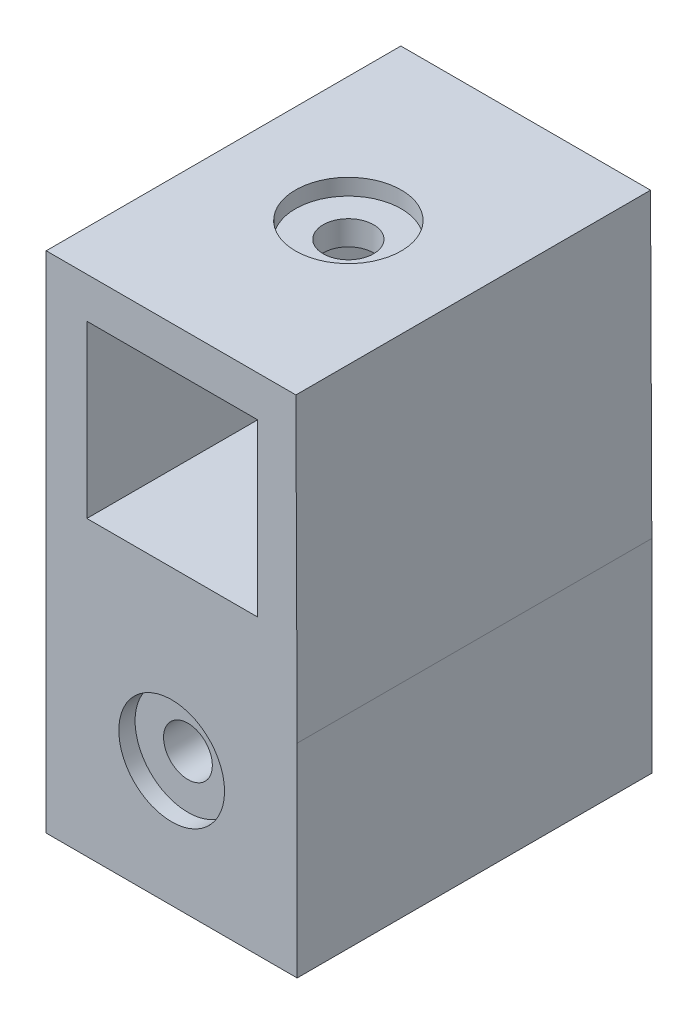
ISO-10303-21;
HEADER;
FILE_DESCRIPTION(('STEP AP214'),'2;1');
FILE_NAME('part.step','',(''),(''),'','','');
FILE_SCHEMA(('AUTOMOTIVE_DESIGN { 1 0 10303 214 1 1 1 1 }'));
ENDSEC;
DATA;
#1=APPLICATION_CONTEXT('core data for automotive mechanical design processes');
#2=APPLICATION_PROTOCOL_DEFINITION('international standard','automotive_design',2000,#1);
#3=PRODUCT_CONTEXT('',#1,'mechanical');
#4=PRODUCT('Part','Part','',(#3));
#5=PRODUCT_RELATED_PRODUCT_CATEGORY('part','',(#4));
#6=PRODUCT_DEFINITION_FORMATION('','',#4);
#7=PRODUCT_DEFINITION_CONTEXT('part definition',#1,'design');
#8=PRODUCT_DEFINITION('design','',#6,#7);
#9=PRODUCT_DEFINITION_SHAPE('','',#8);
#10=(LENGTH_UNIT() NAMED_UNIT(*) SI_UNIT(.MILLI.,.METRE.));
#11=(NAMED_UNIT(*) PLANE_ANGLE_UNIT() SI_UNIT($,.RADIAN.));
#12=(NAMED_UNIT(*) SI_UNIT($,.STERADIAN.) SOLID_ANGLE_UNIT());
#13=UNCERTAINTY_MEASURE_WITH_UNIT(LENGTH_MEASURE(1.E-05),#10,'distance_accuracy_value','');
#14=(GEOMETRIC_REPRESENTATION_CONTEXT(3) GLOBAL_UNCERTAINTY_ASSIGNED_CONTEXT((#13)) GLOBAL_UNIT_ASSIGNED_CONTEXT((#10,
#11,#12)) REPRESENTATION_CONTEXT('',''));
#15=CARTESIAN_POINT('',(0.,0.,0.));
#16=DIRECTION('',(0.,0.,1.));
#17=DIRECTION('',(1.,0.,0.));
#18=AXIS2_PLACEMENT_3D('',#15,#16,#17);
#19=CARTESIAN_POINT('',(-15.5623827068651,-26.3441946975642,-5.2));
#20=DIRECTION('',(0.,0.,1.));
#21=DIRECTION('',(1.,0.,0.));
#22=AXIS2_PLACEMENT_3D('',#19,#20,#21);
#23=CYLINDRICAL_SURFACE('',#22,3.);
#24=CARTESIAN_POINT('',(-15.5623827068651,-26.3441946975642,10.5));
#25=DIRECTION('',(0.,0.,1.));
#26=DIRECTION('',(1.,0.,0.));
#27=AXIS2_PLACEMENT_3D('',#24,#25,#26);
#28=CIRCLE('',#27,3.);
#29=CARTESIAN_POINT('',(-12.5623827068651,-26.3441946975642,10.5));
#30=VERTEX_POINT('',#29);
#31=EDGE_CURVE('E184',#30,#30,#28,.T.);
#32=ORIENTED_EDGE('',*,*,#31,.F.);
#33=EDGE_LOOP('',(#32));
#34=FACE_BOUND('',#33,.T.);
#35=CARTESIAN_POINT('',(-15.5623827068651,-26.3441946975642,19.8));
#36=DIRECTION('',(0.,0.,1.));
#37=DIRECTION('',(1.,0.,0.));
#38=AXIS2_PLACEMENT_3D('',#35,#36,#37);
#39=CIRCLE('',#38,3.);
#40=CARTESIAN_POINT('',(-12.5623827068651,-26.3441946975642,19.8));
#41=VERTEX_POINT('',#40);
#42=EDGE_CURVE('E51',#41,#41,#39,.F.);
#43=ORIENTED_EDGE('',*,*,#42,.F.);
#44=EDGE_LOOP('',(#43));
#45=FACE_BOUND('',#44,.T.);
#46=ADVANCED_FACE('F47',(#34,#45),#23,.F.);
#47=CARTESIAN_POINT('',(-30.989332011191,0.,-21.8));
#48=DIRECTION('',(-1.,0.,0.));
#49=DIRECTION('',(0.,0.,1.));
#50=AXIS2_PLACEMENT_3D('',#47,#48,#49);
#51=PLANE('',#50);
#52=DIRECTION('',(0.,-1.,0.));
#53=VECTOR('',#52,1.);
#54=CARTESIAN_POINT('',(-30.989332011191,0.,-21.8));
#55=LINE('',#54,#53);
#56=CARTESIAN_POINT('',(-30.989332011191,20.241694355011,-21.8));
#57=VERTEX_POINT('',#56);
#58=CARTESIAN_POINT('',(-30.9893320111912,-41.7583056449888,-21.8));
#59=VERTEX_POINT('',#58);
#60=EDGE_CURVE('E290',#57,#59,#55,.T.);
#61=ORIENTED_EDGE('',*,*,#60,.T.);
#62=DIRECTION('',(0.,0.,-1.));
#63=VECTOR('',#62,1.);
#64=CARTESIAN_POINT('',(-30.9893320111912,-41.7583056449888,21.8));
#65=LINE('',#64,#63);
#66=CARTESIAN_POINT('',(-30.9893320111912,-41.7583056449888,21.8));
#67=VERTEX_POINT('',#66);
#68=EDGE_CURVE('E193',#67,#59,#65,.T.);
#69=ORIENTED_EDGE('',*,*,#68,.F.);
#70=DIRECTION('',(0.,-1.,0.));
#71=VECTOR('',#70,1.);
#72=CARTESIAN_POINT('',(-30.989332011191,0.,21.8));
#73=LINE('',#72,#71);
#74=CARTESIAN_POINT('',(-30.989332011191,20.241694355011,21.8));
#75=VERTEX_POINT('',#74);
#76=EDGE_CURVE('E279',#75,#67,#73,.T.);
#77=ORIENTED_EDGE('',*,*,#76,.F.);
#78=DIRECTION('',(0.,0.,1.));
#79=VECTOR('',#78,1.);
#80=CARTESIAN_POINT('',(-30.989332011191,20.241694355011,-21.8));
#81=LINE('',#80,#79);
#82=EDGE_CURVE('E11',#57,#75,#81,.T.);
#83=ORIENTED_EDGE('',*,*,#82,.F.);
#84=EDGE_LOOP('',(#61,#69,#77,#83));
#85=FACE_BOUND('',#84,.T.);
#86=ADVANCED_FACE('F341',(#85),#51,.T.);
#87=CARTESIAN_POINT('',(0.,20.241694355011,-21.8));
#88=DIRECTION('',(0.,1.,0.));
#89=DIRECTION('',(0.,0.,1.));
#90=AXIS2_PLACEMENT_3D('',#87,#88,#89);
#91=PLANE('',#90);
#92=CARTESIAN_POINT('',(-15.6401057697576,20.241694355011,0.));
#93=DIRECTION('',(0.,1.,0.));
#94=DIRECTION('',(0.,0.,1.));
#95=AXIS2_PLACEMENT_3D('',#92,#93,#94);
#96=CIRCLE('',#95,6.5);
#97=CARTESIAN_POINT('',(-15.6401057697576,20.241694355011,6.5));
#98=VERTEX_POINT('',#97);
#99=EDGE_CURVE('E262',#98,#98,#96,.T.);
#100=ORIENTED_EDGE('',*,*,#99,.F.);
#101=EDGE_LOOP('',(#100));
#102=FACE_BOUND('',#101,.T.);
#103=ORIENTED_EDGE('',*,*,#82,.T.);
#104=DIRECTION('',(-1.,0.,0.));
#105=VECTOR('',#104,1.);
#106=CARTESIAN_POINT('',(0.,20.241694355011,21.8));
#107=LINE('',#106,#105);
#108=CARTESIAN_POINT('',(-0.290879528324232,20.241694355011,21.8));
#109=VERTEX_POINT('',#108);
#110=EDGE_CURVE('E275',#109,#75,#107,.T.);
#111=ORIENTED_EDGE('',*,*,#110,.F.);
#112=DIRECTION('',(0.,0.,1.));
#113=VECTOR('',#112,1.);
#114=CARTESIAN_POINT('',(-0.290879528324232,20.241694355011,-21.8));
#115=LINE('',#114,#113);
#116=CARTESIAN_POINT('',(-0.290879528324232,20.241694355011,-21.8));
#117=VERTEX_POINT('',#116);
#118=EDGE_CURVE('E57',#117,#109,#115,.T.);
#119=ORIENTED_EDGE('',*,*,#118,.F.);
#120=DIRECTION('',(-1.,0.,0.));
#121=VECTOR('',#120,1.);
#122=CARTESIAN_POINT('',(0.,20.241694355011,-21.8));
#123=LINE('',#122,#121);
#124=EDGE_CURVE('E286',#117,#57,#123,.T.);
#125=ORIENTED_EDGE('',*,*,#124,.T.);
#126=EDGE_LOOP('',(#103,#111,#119,#125));
#127=FACE_BOUND('',#126,.T.);
#128=ADVANCED_FACE('F354',(#102,#127),#91,.T.);
#129=CARTESIAN_POINT('',(-0.205835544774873,-0.000864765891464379,-21.8));
#130=DIRECTION('',(0.999991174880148,0.00420120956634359,0.));
#131=DIRECTION('',(-0.00420120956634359,0.999991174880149,0.));
#132=AXIS2_PLACEMENT_3D('',#129,#130,#131);
#133=PLANE('',#132);
#134=ORIENTED_EDGE('',*,*,#118,.T.);
#135=DIRECTION('',(-0.00420120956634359,0.999991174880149,0.));
#136=VECTOR('',#135,1.);
#137=CARTESIAN_POINT('',(-0.205835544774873,-0.000864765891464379,21.8));
#138=LINE('',#137,#136);
#139=CARTESIAN_POINT('',(-0.135433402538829,-16.7583056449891,21.8));
#140=VERTEX_POINT('',#139);
#141=EDGE_CURVE('E271',#140,#109,#138,.T.);
#142=ORIENTED_EDGE('',*,*,#141,.F.);
#143=DIRECTION('',(0.,0.,1.));
#144=VECTOR('',#143,1.);
#145=CARTESIAN_POINT('',(-0.135433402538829,-16.758305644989,-21.8));
#146=LINE('',#145,#144);
#147=CARTESIAN_POINT('',(-0.135433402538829,-16.7583056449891,-21.8));
#148=VERTEX_POINT('',#147);
#149=EDGE_CURVE('E292',#148,#140,#146,.T.);
#150=ORIENTED_EDGE('',*,*,#149,.F.);
#151=DIRECTION('',(-0.00420120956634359,0.999991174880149,0.));
#152=VECTOR('',#151,1.);
#153=CARTESIAN_POINT('',(-0.205835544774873,-0.000864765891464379,-21.8));
#154=LINE('',#153,#152);
#155=EDGE_CURVE('E282',#148,#117,#154,.T.);
#156=ORIENTED_EDGE('',*,*,#155,.T.);
#157=EDGE_LOOP('',(#134,#142,#150,#156));
#158=FACE_BOUND('',#157,.T.);
#159=ADVANCED_FACE('F49',(#158),#133,.T.);
#160=CARTESIAN_POINT('',(0.,0.,-21.8));
#161=DIRECTION('',(0.,0.,1.));
#162=DIRECTION('',(1.,0.,0.));
#163=AXIS2_PLACEMENT_3D('',#160,#161,#162);
#164=PLANE('',#163);
#165=DIRECTION('',(1.,0.,0.));
#166=VECTOR('',#165,1.);
#167=CARTESIAN_POINT('',(0.,-5.75830564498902,-21.8));
#168=LINE('',#167,#166);
#169=CARTESIAN_POINT('',(-25.989332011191,-5.75830564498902,-21.8));
#170=VERTEX_POINT('',#169);
#171=CARTESIAN_POINT('',(-4.98933201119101,-5.75830564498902,-21.8));
#172=VERTEX_POINT('',#171);
#173=EDGE_CURVE('E254',#170,#172,#168,.T.);
#174=ORIENTED_EDGE('',*,*,#173,.T.);
#175=DIRECTION('',(0.,1.,0.));
#176=VECTOR('',#175,1.);
#177=CARTESIAN_POINT('',(-4.98933201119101,0.,-21.8));
#178=LINE('',#177,#176);
#179=CARTESIAN_POINT('',(-4.98933201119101,15.241694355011,-21.8));
#180=VERTEX_POINT('',#179);
#181=EDGE_CURVE('E258',#172,#180,#178,.T.);
#182=ORIENTED_EDGE('',*,*,#181,.T.);
#183=DIRECTION('',(-1.,0.,0.));
#184=VECTOR('',#183,1.);
#185=CARTESIAN_POINT('',(0.,15.241694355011,-21.8));
#186=LINE('',#185,#184);
#187=CARTESIAN_POINT('',(-25.989332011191,15.241694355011,-21.8));
#188=VERTEX_POINT('',#187);
#189=EDGE_CURVE('E246',#180,#188,#186,.T.);
#190=ORIENTED_EDGE('',*,*,#189,.T.);
#191=DIRECTION('',(0.,-1.,0.));
#192=VECTOR('',#191,1.);
#193=CARTESIAN_POINT('',(-25.989332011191,0.,-21.8));
#194=LINE('',#193,#192);
#195=EDGE_CURVE('E250',#188,#170,#194,.T.);
#196=ORIENTED_EDGE('',*,*,#195,.T.);
#197=EDGE_LOOP('',(#174,#182,#190,#196));
#198=FACE_BOUND('',#197,.T.);
#199=ORIENTED_EDGE('',*,*,#155,.F.);
#200=DIRECTION('',(0.,1.,0.));
#201=VECTOR('',#200,1.);
#202=CARTESIAN_POINT('',(-0.135433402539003,-41.7583056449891,-21.8));
#203=LINE('',#202,#201);
#204=CARTESIAN_POINT('',(-0.135433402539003,-41.7583056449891,-21.8));
#205=VERTEX_POINT('',#204);
#206=EDGE_CURVE('E216',#205,#148,#203,.T.);
#207=ORIENTED_EDGE('',*,*,#206,.F.);
#208=DIRECTION('',(1.,0.,0.));
#209=VECTOR('',#208,1.);
#210=CARTESIAN_POINT('',(-30.9893320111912,-41.7583056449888,-21.8));
#211=LINE('',#210,#209);
#212=EDGE_CURVE('E202',#59,#205,#211,.T.);
#213=ORIENTED_EDGE('',*,*,#212,.F.);
#214=ORIENTED_EDGE('',*,*,#60,.F.);
#215=ORIENTED_EDGE('',*,*,#124,.F.);
#216=EDGE_LOOP('',(#199,#207,#213,#214,#215));
#217=FACE_BOUND('',#216,.T.);
#218=ADVANCED_FACE('F326',(#198,#217),#164,.F.);
#219=CARTESIAN_POINT('',(0.,0.,21.8));
#220=DIRECTION('',(0.,0.,1.));
#221=DIRECTION('',(1.,0.,0.));
#222=AXIS2_PLACEMENT_3D('',#219,#220,#221);
#223=PLANE('',#222);
#224=CARTESIAN_POINT('',(-15.5623827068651,-26.3441946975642,21.8));
#225=DIRECTION('',(0.,0.,1.));
#226=DIRECTION('',(1.,0.,0.));
#227=AXIS2_PLACEMENT_3D('',#224,#225,#226);
#228=CIRCLE('',#227,6.5);
#229=CARTESIAN_POINT('',(-9.06238270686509,-26.3441946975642,21.8));
#230=VERTEX_POINT('',#229);
#231=EDGE_CURVE('E174',#230,#230,#228,.T.);
#232=ORIENTED_EDGE('',*,*,#231,.F.);
#233=EDGE_LOOP('',(#232));
#234=FACE_BOUND('',#233,.T.);
#235=DIRECTION('',(0.,1.,0.));
#236=VECTOR('',#235,1.);
#237=CARTESIAN_POINT('',(-4.98933201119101,-5.75830564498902,21.8));
#238=LINE('',#237,#236);
#239=CARTESIAN_POINT('',(-4.98933201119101,-5.75830564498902,21.8));
#240=VERTEX_POINT('',#239);
#241=CARTESIAN_POINT('',(-4.98933201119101,15.241694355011,21.8));
#242=VERTEX_POINT('',#241);
#243=EDGE_CURVE('E219',#240,#242,#238,.T.);
#244=ORIENTED_EDGE('',*,*,#243,.F.);
#245=DIRECTION('',(1.,0.,0.));
#246=VECTOR('',#245,1.);
#247=CARTESIAN_POINT('',(-25.989332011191,-5.75830564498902,21.8));
#248=LINE('',#247,#246);
#249=CARTESIAN_POINT('',(-25.989332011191,-5.75830564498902,21.8));
#250=VERTEX_POINT('',#249);
#251=EDGE_CURVE('E229',#250,#240,#248,.T.);
#252=ORIENTED_EDGE('',*,*,#251,.F.);
#253=DIRECTION('',(0.,-1.,0.));
#254=VECTOR('',#253,1.);
#255=CARTESIAN_POINT('',(-25.989332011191,-5.75830564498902,21.8));
#256=LINE('',#255,#254);
#257=CARTESIAN_POINT('',(-25.989332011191,15.241694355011,21.8));
#258=VERTEX_POINT('',#257);
#259=EDGE_CURVE('E225',#258,#250,#256,.T.);
#260=ORIENTED_EDGE('',*,*,#259,.F.);
#261=DIRECTION('',(-1.,0.,0.));
#262=VECTOR('',#261,1.);
#263=CARTESIAN_POINT('',(-25.989332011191,15.241694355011,21.8));
#264=LINE('',#263,#262);
#265=EDGE_CURVE('E222',#242,#258,#264,.T.);
#266=ORIENTED_EDGE('',*,*,#265,.F.);
#267=EDGE_LOOP('',(#244,#252,#260,#266));
#268=FACE_BOUND('',#267,.T.);
#269=ORIENTED_EDGE('',*,*,#76,.T.);
#270=DIRECTION('',(-1.,0.,0.));
#271=VECTOR('',#270,1.);
#272=CARTESIAN_POINT('',(-30.9893320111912,-41.7583056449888,21.8));
#273=LINE('',#272,#271);
#274=CARTESIAN_POINT('',(-0.135433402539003,-41.7583056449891,21.8));
#275=VERTEX_POINT('',#274);
#276=EDGE_CURVE('E208',#275,#67,#273,.T.);
#277=ORIENTED_EDGE('',*,*,#276,.F.);
#278=DIRECTION('',(0.,1.,0.));
#279=VECTOR('',#278,1.);
#280=CARTESIAN_POINT('',(-0.135433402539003,-41.7583056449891,21.8));
#281=LINE('',#280,#279);
#282=EDGE_CURVE('E212',#275,#140,#281,.T.);
#283=ORIENTED_EDGE('',*,*,#282,.T.);
#284=ORIENTED_EDGE('',*,*,#141,.T.);
#285=ORIENTED_EDGE('',*,*,#110,.T.);
#286=EDGE_LOOP('',(#269,#277,#283,#284,#285));
#287=FACE_BOUND('',#286,.T.);
#288=ADVANCED_FACE('F322',(#234,#268,#287),#223,.T.);
#289=CARTESIAN_POINT('',(-15.6401057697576,18.241694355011,0.));
#290=DIRECTION('',(0.,1.,0.));
#291=DIRECTION('',(0.,0.,1.));
#292=AXIS2_PLACEMENT_3D('',#289,#290,#291);
#293=PLANE('',#292);
#294=CARTESIAN_POINT('',(-15.6401057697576,18.241694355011,0.));
#295=DIRECTION('',(0.,1.,0.));
#296=DIRECTION('',(0.,0.,1.));
#297=AXIS2_PLACEMENT_3D('',#294,#295,#296);
#298=CIRCLE('',#297,6.5);
#299=CARTESIAN_POINT('',(-15.6401057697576,18.241694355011,6.5));
#300=VERTEX_POINT('',#299);
#301=EDGE_CURVE('E263',#300,#300,#298,.T.);
#302=ORIENTED_EDGE('',*,*,#301,.T.);
#303=EDGE_LOOP('',(#302));
#304=FACE_BOUND('',#303,.T.);
#305=CARTESIAN_POINT('',(-15.6401057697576,18.241694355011,0.));
#306=DIRECTION('',(0.,1.,0.));
#307=DIRECTION('',(0.,0.,1.));
#308=AXIS2_PLACEMENT_3D('',#305,#306,#307);
#309=CIRCLE('',#308,3.1);
#310=CARTESIAN_POINT('',(-15.6401057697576,18.241694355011,3.1));
#311=VERTEX_POINT('',#310);
#312=EDGE_CURVE('E267',#311,#311,#309,.F.);
#313=ORIENTED_EDGE('',*,*,#312,.T.);
#314=EDGE_LOOP('',(#313));
#315=FACE_BOUND('',#314,.T.);
#316=ADVANCED_FACE('F325',(#304,#315),#293,.T.);
#317=CARTESIAN_POINT('',(-15.6401057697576,18.241694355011,0.));
#318=DIRECTION('',(0.,1.,0.));
#319=DIRECTION('',(0.,0.,1.));
#320=AXIS2_PLACEMENT_3D('',#317,#318,#319);
#321=CYLINDRICAL_SURFACE('',#320,6.5);
#322=ORIENTED_EDGE('',*,*,#301,.F.);
#323=EDGE_LOOP('',(#322));
#324=FACE_BOUND('',#323,.T.);
#325=ORIENTED_EDGE('',*,*,#99,.T.);
#326=EDGE_LOOP('',(#325));
#327=FACE_BOUND('',#326,.T.);
#328=ADVANCED_FACE('F410',(#324,#327),#321,.F.);
#329=CARTESIAN_POINT('',(-15.6401057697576,10.241694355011,0.));
#330=DIRECTION('',(0.,1.,0.));
#331=DIRECTION('',(0.,0.,1.));
#332=AXIS2_PLACEMENT_3D('',#329,#330,#331);
#333=CYLINDRICAL_SURFACE('',#332,3.1);
#334=CARTESIAN_POINT('',(-15.6401057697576,15.241694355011,0.));
#335=DIRECTION('',(0.,1.,0.));
#336=DIRECTION('',(0.,0.,1.));
#337=AXIS2_PLACEMENT_3D('',#334,#335,#336);
#338=CIRCLE('',#337,3.1);
#339=CARTESIAN_POINT('',(-15.6401057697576,15.241694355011,3.1));
#340=VERTEX_POINT('',#339);
#341=EDGE_CURVE('E237',#340,#340,#338,.F.);
#342=ORIENTED_EDGE('',*,*,#341,.T.);
#343=EDGE_LOOP('',(#342));
#344=FACE_BOUND('',#343,.T.);
#345=ORIENTED_EDGE('',*,*,#312,.F.);
#346=EDGE_LOOP('',(#345));
#347=FACE_BOUND('',#346,.T.);
#348=ADVANCED_FACE('F406',(#344,#347),#333,.F.);
#349=CARTESIAN_POINT('',(-4.98933201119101,-5.75830564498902,-38.2));
#350=DIRECTION('',(1.,0.,0.));
#351=DIRECTION('',(0.,0.,-1.));
#352=AXIS2_PLACEMENT_3D('',#349,#350,#351);
#353=PLANE('',#352);
#354=DIRECTION('',(0.,0.,1.));
#355=VECTOR('',#354,1.);
#356=CARTESIAN_POINT('',(-4.98933201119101,-5.75830564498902,-38.2));
#357=LINE('',#356,#355);
#358=EDGE_CURVE('E234',#172,#240,#357,.T.);
#359=ORIENTED_EDGE('',*,*,#358,.T.);
#360=ORIENTED_EDGE('',*,*,#243,.T.);
#361=DIRECTION('',(0.,0.,1.));
#362=VECTOR('',#361,1.);
#363=CARTESIAN_POINT('',(-4.98933201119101,15.241694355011,-38.2));
#364=LINE('',#363,#362);
#365=EDGE_CURVE('E233',#180,#242,#364,.T.);
#366=ORIENTED_EDGE('',*,*,#365,.F.);
#367=ORIENTED_EDGE('',*,*,#181,.F.);
#368=EDGE_LOOP('',(#359,#360,#366,#367));
#369=FACE_BOUND('',#368,.T.);
#370=ADVANCED_FACE('F396',(#369),#353,.F.);
#371=CARTESIAN_POINT('',(-25.989332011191,-5.75830564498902,-38.2));
#372=DIRECTION('',(0.,-1.,0.));
#373=DIRECTION('',(0.,0.,-1.));
#374=AXIS2_PLACEMENT_3D('',#371,#372,#373);
#375=PLANE('',#374);
#376=DIRECTION('',(0.,0.,1.));
#377=VECTOR('',#376,1.);
#378=CARTESIAN_POINT('',(-25.989332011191,-5.75830564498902,-38.2));
#379=LINE('',#378,#377);
#380=EDGE_CURVE('E238',#170,#250,#379,.T.);
#381=ORIENTED_EDGE('',*,*,#380,.T.);
#382=ORIENTED_EDGE('',*,*,#251,.T.);
#383=ORIENTED_EDGE('',*,*,#358,.F.);
#384=ORIENTED_EDGE('',*,*,#173,.F.);
#385=EDGE_LOOP('',(#381,#382,#383,#384));
#386=FACE_BOUND('',#385,.T.);
#387=ADVANCED_FACE('F392',(#386),#375,.F.);
#388=CARTESIAN_POINT('',(-25.989332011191,-5.75830564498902,-38.2));
#389=DIRECTION('',(-1.,0.,0.));
#390=DIRECTION('',(0.,0.,1.));
#391=AXIS2_PLACEMENT_3D('',#388,#389,#390);
#392=PLANE('',#391);
#393=DIRECTION('',(0.,0.,1.));
#394=VECTOR('',#393,1.);
#395=CARTESIAN_POINT('',(-25.989332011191,15.241694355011,-38.2));
#396=LINE('',#395,#394);
#397=EDGE_CURVE('E73',#188,#258,#396,.T.);
#398=ORIENTED_EDGE('',*,*,#397,.T.);
#399=ORIENTED_EDGE('',*,*,#259,.T.);
#400=ORIENTED_EDGE('',*,*,#380,.F.);
#401=ORIENTED_EDGE('',*,*,#195,.F.);
#402=EDGE_LOOP('',(#398,#399,#400,#401));
#403=FACE_BOUND('',#402,.T.);
#404=ADVANCED_FACE('F395',(#403),#392,.F.);
#405=CARTESIAN_POINT('',(-25.989332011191,15.241694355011,-38.2));
#406=DIRECTION('',(0.,1.,0.));
#407=DIRECTION('',(0.,0.,1.));
#408=AXIS2_PLACEMENT_3D('',#405,#406,#407);
#409=PLANE('',#408);
#410=ORIENTED_EDGE('',*,*,#341,.F.);
#411=EDGE_LOOP('',(#410));
#412=FACE_BOUND('',#411,.T.);
#413=ORIENTED_EDGE('',*,*,#365,.T.);
#414=ORIENTED_EDGE('',*,*,#265,.T.);
#415=ORIENTED_EDGE('',*,*,#397,.F.);
#416=ORIENTED_EDGE('',*,*,#189,.F.);
#417=EDGE_LOOP('',(#413,#414,#415,#416));
#418=FACE_BOUND('',#417,.T.);
#419=ADVANCED_FACE('F391',(#412,#418),#409,.F.);
#420=CARTESIAN_POINT('',(-0.135433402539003,-41.7583056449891,21.8));
#421=DIRECTION('',(-1.,0.,0.));
#422=DIRECTION('',(0.,-1.,0.));
#423=AXIS2_PLACEMENT_3D('',#420,#421,#422);
#424=PLANE('',#423);
#425=ORIENTED_EDGE('',*,*,#149,.T.);
#426=ORIENTED_EDGE('',*,*,#282,.F.);
#427=DIRECTION('',(0.,0.,1.));
#428=VECTOR('',#427,1.);
#429=CARTESIAN_POINT('',(-0.135433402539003,-41.7583056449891,21.8));
#430=LINE('',#429,#428);
#431=EDGE_CURVE('E205',#205,#275,#430,.T.);
#432=ORIENTED_EDGE('',*,*,#431,.F.);
#433=ORIENTED_EDGE('',*,*,#206,.T.);
#434=EDGE_LOOP('',(#425,#426,#432,#433));
#435=FACE_BOUND('',#434,.T.);
#436=ADVANCED_FACE('F350',(#435),#424,.F.);
#437=CARTESIAN_POINT('',(-2.91287387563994E-13,-41.7583056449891,0.));
#438=DIRECTION('',(0.,-1.,0.));
#439=DIRECTION('',(1.,0.,0.));
#440=AXIS2_PLACEMENT_3D('',#437,#438,#439);
#441=PLANE('',#440);
#442=DIRECTION('',(0.,0.,-1.));
#443=VECTOR('',#442,1.);
#444=CARTESIAN_POINT('',(-25.9893320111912,-41.7583056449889,10.5));
#445=LINE('',#444,#443);
#446=CARTESIAN_POINT('',(-25.9893320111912,-41.7583056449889,10.5));
#447=VERTEX_POINT('',#446);
#448=CARTESIAN_POINT('',(-25.9893320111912,-41.7583056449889,-10.5));
#449=VERTEX_POINT('',#448);
#450=EDGE_CURVE('E65',#447,#449,#445,.T.);
#451=ORIENTED_EDGE('',*,*,#450,.F.);
#452=DIRECTION('',(-1.,0.,0.));
#453=VECTOR('',#452,1.);
#454=CARTESIAN_POINT('',(-25.9893320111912,-41.7583056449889,10.5));
#455=LINE('',#454,#453);
#456=CARTESIAN_POINT('',(-4.98933201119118,-41.758305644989,10.5));
#457=VERTEX_POINT('',#456);
#458=EDGE_CURVE('E167',#457,#447,#455,.T.);
#459=ORIENTED_EDGE('',*,*,#458,.F.);
#460=DIRECTION('',(0.,0.,1.));
#461=VECTOR('',#460,1.);
#462=CARTESIAN_POINT('',(-4.98933201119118,-41.758305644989,10.5));
#463=LINE('',#462,#461);
#464=CARTESIAN_POINT('',(-4.98933201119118,-41.758305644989,-10.5));
#465=VERTEX_POINT('',#464);
#466=EDGE_CURVE('E171',#465,#457,#463,.T.);
#467=ORIENTED_EDGE('',*,*,#466,.F.);
#468=DIRECTION('',(1.,0.,0.));
#469=VECTOR('',#468,1.);
#470=CARTESIAN_POINT('',(-25.9893320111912,-41.7583056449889,-10.5));
#471=LINE('',#470,#469);
#472=EDGE_CURVE('E183',#449,#465,#471,.T.);
#473=ORIENTED_EDGE('',*,*,#472,.F.);
#474=EDGE_LOOP('',(#451,#459,#467,#473));
#475=FACE_BOUND('',#474,.T.);
#476=ORIENTED_EDGE('',*,*,#68,.T.);
#477=ORIENTED_EDGE('',*,*,#212,.T.);
#478=ORIENTED_EDGE('',*,*,#431,.T.);
#479=ORIENTED_EDGE('',*,*,#276,.T.);
#480=EDGE_LOOP('',(#476,#477,#478,#479));
#481=FACE_BOUND('',#480,.T.);
#482=ADVANCED_FACE('F338',(#475,#481),#441,.T.);
#483=CARTESIAN_POINT('',(-25.989332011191,-14.7583056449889,10.5));
#484=DIRECTION('',(-1.,0.,0.));
#485=DIRECTION('',(0.,-1.,0.));
#486=AXIS2_PLACEMENT_3D('',#483,#484,#485);
#487=PLANE('',#486);
#488=ORIENTED_EDGE('',*,*,#450,.T.);
#489=DIRECTION('',(0.,-1.,0.));
#490=VECTOR('',#489,1.);
#491=CARTESIAN_POINT('',(-25.989332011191,-14.7583056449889,-10.5));
#492=LINE('',#491,#490);
#493=CARTESIAN_POINT('',(-25.989332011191,-14.7583056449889,-10.5));
#494=VERTEX_POINT('',#493);
#495=EDGE_CURVE('E142',#494,#449,#492,.T.);
#496=ORIENTED_EDGE('',*,*,#495,.F.);
#497=DIRECTION('',(0.,0.,-1.));
#498=VECTOR('',#497,1.);
#499=CARTESIAN_POINT('',(-25.989332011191,-14.7583056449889,10.5));
#500=LINE('',#499,#498);
#501=CARTESIAN_POINT('',(-25.989332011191,-14.7583056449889,10.5));
#502=VERTEX_POINT('',#501);
#503=EDGE_CURVE('E146',#502,#494,#500,.T.);
#504=ORIENTED_EDGE('',*,*,#503,.F.);
#505=DIRECTION('',(0.,-1.,0.));
#506=VECTOR('',#505,1.);
#507=CARTESIAN_POINT('',(-25.989332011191,-14.7583056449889,10.5));
#508=LINE('',#507,#506);
#509=EDGE_CURVE('E190',#502,#447,#508,.T.);
#510=ORIENTED_EDGE('',*,*,#509,.T.);
#511=EDGE_LOOP('',(#488,#496,#504,#510));
#512=FACE_BOUND('',#511,.T.);
#513=ADVANCED_FACE('F144',(#512),#487,.F.);
#514=CARTESIAN_POINT('',(-25.989332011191,-14.7583056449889,10.5));
#515=DIRECTION('',(0.,0.,1.));
#516=DIRECTION('',(1.,0.,0.));
#517=AXIS2_PLACEMENT_3D('',#514,#515,#516);
#518=PLANE('',#517);
#519=ORIENTED_EDGE('',*,*,#31,.T.);
#520=EDGE_LOOP('',(#519));
#521=FACE_BOUND('',#520,.T.);
#522=ORIENTED_EDGE('',*,*,#458,.T.);
#523=ORIENTED_EDGE('',*,*,#509,.F.);
#524=DIRECTION('',(-1.,0.,0.));
#525=VECTOR('',#524,1.);
#526=CARTESIAN_POINT('',(-25.989332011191,-14.7583056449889,10.5));
#527=LINE('',#526,#525);
#528=CARTESIAN_POINT('',(-4.98933201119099,-14.758305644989,10.5));
#529=VERTEX_POINT('',#528);
#530=EDGE_CURVE('E153',#529,#502,#527,.T.);
#531=ORIENTED_EDGE('',*,*,#530,.F.);
#532=DIRECTION('',(0.,-1.,0.));
#533=VECTOR('',#532,1.);
#534=CARTESIAN_POINT('',(-4.98933201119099,-14.758305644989,10.5));
#535=LINE('',#534,#533);
#536=EDGE_CURVE('E194',#529,#457,#535,.T.);
#537=ORIENTED_EDGE('',*,*,#536,.T.);
#538=EDGE_LOOP('',(#522,#523,#531,#537));
#539=FACE_BOUND('',#538,.T.);
#540=ADVANCED_FACE('F375',(#521,#539),#518,.F.);
#541=CARTESIAN_POINT('',(-4.98933201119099,-14.758305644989,10.5));
#542=DIRECTION('',(1.,0.,0.));
#543=DIRECTION('',(0.,1.,0.));
#544=AXIS2_PLACEMENT_3D('',#541,#542,#543);
#545=PLANE('',#544);
#546=ORIENTED_EDGE('',*,*,#466,.T.);
#547=ORIENTED_EDGE('',*,*,#536,.F.);
#548=DIRECTION('',(0.,0.,1.));
#549=VECTOR('',#548,1.);
#550=CARTESIAN_POINT('',(-4.98933201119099,-14.758305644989,10.5));
#551=LINE('',#550,#549);
#552=CARTESIAN_POINT('',(-4.98933201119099,-14.758305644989,-10.5));
#553=VERTEX_POINT('',#552);
#554=EDGE_CURVE('E162',#553,#529,#551,.T.);
#555=ORIENTED_EDGE('',*,*,#554,.F.);
#556=DIRECTION('',(0.,-1.,0.));
#557=VECTOR('',#556,1.);
#558=CARTESIAN_POINT('',(-4.98933201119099,-14.758305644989,-10.5));
#559=LINE('',#558,#557);
#560=EDGE_CURVE('E152',#553,#465,#559,.T.);
#561=ORIENTED_EDGE('',*,*,#560,.T.);
#562=EDGE_LOOP('',(#546,#547,#555,#561));
#563=FACE_BOUND('',#562,.T.);
#564=ADVANCED_FACE('F378',(#563),#545,.F.);
#565=CARTESIAN_POINT('',(-25.989332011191,-14.7583056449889,-10.5));
#566=DIRECTION('',(0.,0.,-1.));
#567=DIRECTION('',(-1.,0.,0.));
#568=AXIS2_PLACEMENT_3D('',#565,#566,#567);
#569=PLANE('',#568);
#570=ORIENTED_EDGE('',*,*,#472,.T.);
#571=ORIENTED_EDGE('',*,*,#560,.F.);
#572=DIRECTION('',(1.,0.,0.));
#573=VECTOR('',#572,1.);
#574=CARTESIAN_POINT('',(-25.989332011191,-14.7583056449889,-10.5));
#575=LINE('',#574,#573);
#576=EDGE_CURVE('E156',#494,#553,#575,.T.);
#577=ORIENTED_EDGE('',*,*,#576,.F.);
#578=ORIENTED_EDGE('',*,*,#495,.T.);
#579=EDGE_LOOP('',(#570,#571,#577,#578));
#580=FACE_BOUND('',#579,.T.);
#581=ADVANCED_FACE('F157',(#580),#569,.F.);
#582=CARTESIAN_POINT('',(-1.01519164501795E-13,-14.7583056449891,0.));
#583=DIRECTION('',(0.,-1.,0.));
#584=DIRECTION('',(1.,0.,0.));
#585=AXIS2_PLACEMENT_3D('',#582,#583,#584);
#586=PLANE('',#585);
#587=ORIENTED_EDGE('',*,*,#503,.T.);
#588=ORIENTED_EDGE('',*,*,#576,.T.);
#589=ORIENTED_EDGE('',*,*,#554,.T.);
#590=ORIENTED_EDGE('',*,*,#530,.T.);
#591=EDGE_LOOP('',(#587,#588,#589,#590));
#592=FACE_BOUND('',#591,.T.);
#593=ADVANCED_FACE('F164',(#592),#586,.T.);
#594=CARTESIAN_POINT('',(-15.5623827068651,-26.3441946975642,19.8));
#595=DIRECTION('',(0.,0.,1.));
#596=DIRECTION('',(1.,0.,0.));
#597=AXIS2_PLACEMENT_3D('',#594,#595,#596);
#598=PLANE('',#597);
#599=CARTESIAN_POINT('',(-15.5623827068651,-26.3441946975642,19.8));
#600=DIRECTION('',(0.,0.,1.));
#601=DIRECTION('',(1.,0.,0.));
#602=AXIS2_PLACEMENT_3D('',#599,#600,#601);
#603=CIRCLE('',#602,6.5);
#604=CARTESIAN_POINT('',(-9.06238270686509,-26.3441946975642,19.8));
#605=VERTEX_POINT('',#604);
#606=EDGE_CURVE('E309',#605,#605,#603,.T.);
#607=ORIENTED_EDGE('',*,*,#606,.T.);
#608=EDGE_LOOP('',(#607));
#609=FACE_BOUND('',#608,.T.);
#610=ORIENTED_EDGE('',*,*,#42,.T.);
#611=EDGE_LOOP('',(#610));
#612=FACE_BOUND('',#611,.T.);
#613=ADVANCED_FACE('F374',(#609,#612),#598,.T.);
#614=CARTESIAN_POINT('',(-15.5623827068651,-26.3441946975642,19.8));
#615=DIRECTION('',(0.,0.,1.));
#616=DIRECTION('',(1.,0.,0.));
#617=AXIS2_PLACEMENT_3D('',#614,#615,#616);
#618=CYLINDRICAL_SURFACE('',#617,6.5);
#619=ORIENTED_EDGE('',*,*,#606,.F.);
#620=EDGE_LOOP('',(#619));
#621=FACE_BOUND('',#620,.T.);
#622=ORIENTED_EDGE('',*,*,#231,.T.);
#623=EDGE_LOOP('',(#622));
#624=FACE_BOUND('',#623,.T.);
#625=ADVANCED_FACE('F320',(#621,#624),#618,.F.);
#626=CLOSED_SHELL('',(#46,#86,#128,#159,#218,#288,#316,#328,#348,#370,#387,#404,#419,#436,#482,
#513,#540,#564,#581,#593,#613,#625));
#627=MANIFOLD_SOLID_BREP('B2',#626);
#628=ADVANCED_BREP_SHAPE_REPRESENTATION('',(#18,#627),#14);
#629=SHAPE_DEFINITION_REPRESENTATION(#9,#628);
ENDSEC;
END-ISO-10303-21;
